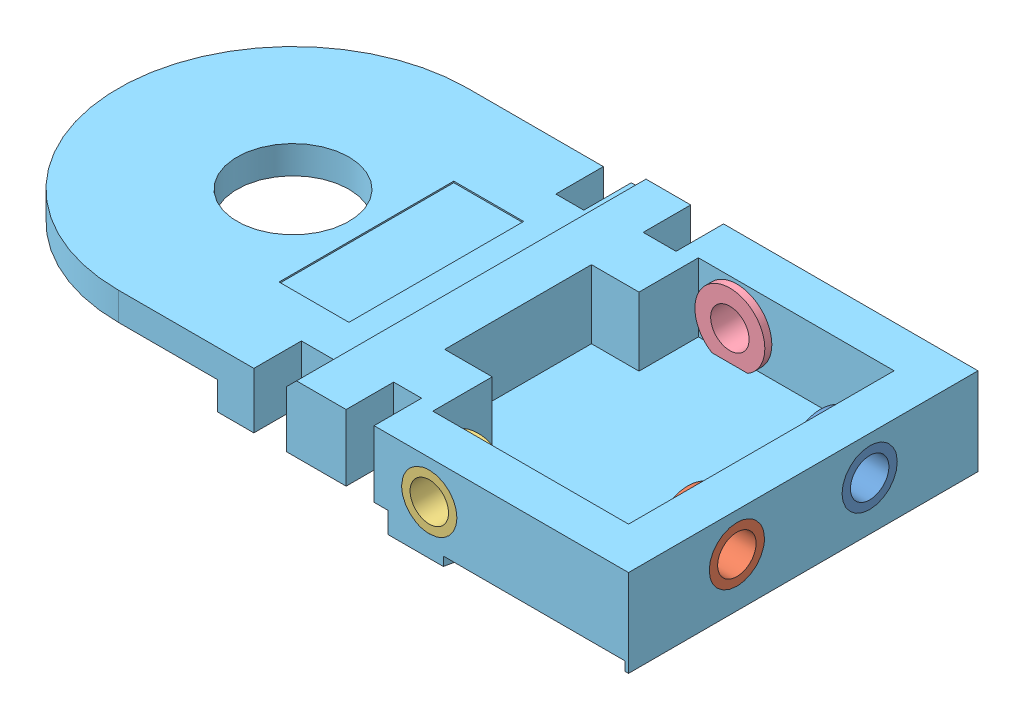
SolidWorks assembly 2024_10_24_12_30_42_0989.sldasm, configuration Standard (file format 10000). Lengths in mm.
Overall size (98 12.5 50).
5 component instances, 5 part files, 0 mates.
Components (placement in the parent):
- 2024_10_24_12_30_43_0192-1: 2024_10_24_12_30_43_0192.sldprt [Standard] at origin size (7 10 10)
- 2024_10_24_12_30_43_0176-1: 2024_10_24_12_30_43_0176.sldprt [Standard] at origin size (7 10 10)
- 2024_10_24_12_30_43_0161-1: 2024_10_24_12_30_43_0161.sldprt [Standard] at origin size (10 10 7)
- 2024_10_24_12_30_43_0145-1: 2024_10_24_12_30_43_0145.sldprt [Standard] at origin size (10 10 7)
- 2024_10_24_12_30_43_0129-1: 2024_10_24_12_30_43_0129.sldprt [Standard] at origin size (98 12.5 50)
